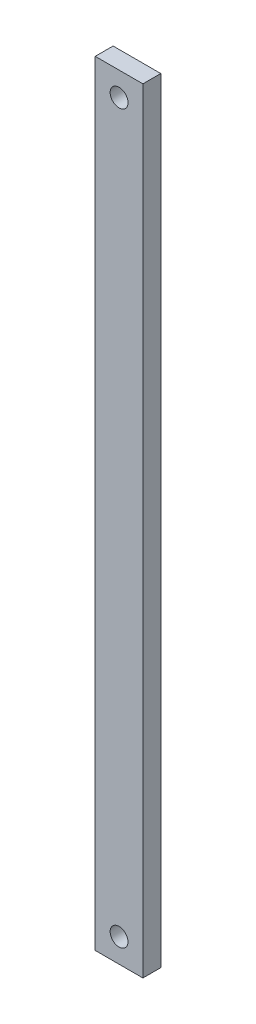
ISO-10303-21;
HEADER;
FILE_DESCRIPTION(('STEP AP214'),'2;1');
FILE_NAME('part.step','',(''),(''),'','','');
FILE_SCHEMA(('AUTOMOTIVE_DESIGN { 1 0 10303 214 1 1 1 1 }'));
ENDSEC;
DATA;
#1=APPLICATION_CONTEXT('core data for automotive mechanical design processes');
#2=APPLICATION_PROTOCOL_DEFINITION('international standard','automotive_design',2000,#1);
#3=PRODUCT_CONTEXT('',#1,'mechanical');
#4=PRODUCT('Part','Part','',(#3));
#5=PRODUCT_RELATED_PRODUCT_CATEGORY('part','',(#4));
#6=PRODUCT_DEFINITION_FORMATION('','',#4);
#7=PRODUCT_DEFINITION_CONTEXT('part definition',#1,'design');
#8=PRODUCT_DEFINITION('design','',#6,#7);
#9=PRODUCT_DEFINITION_SHAPE('','',#8);
#10=(LENGTH_UNIT() NAMED_UNIT(*) SI_UNIT(.MILLI.,.METRE.));
#11=(NAMED_UNIT(*) PLANE_ANGLE_UNIT() SI_UNIT($,.RADIAN.));
#12=(NAMED_UNIT(*) SI_UNIT($,.STERADIAN.) SOLID_ANGLE_UNIT());
#13=UNCERTAINTY_MEASURE_WITH_UNIT(LENGTH_MEASURE(1.E-05),#10,'distance_accuracy_value','');
#14=(GEOMETRIC_REPRESENTATION_CONTEXT(3) GLOBAL_UNCERTAINTY_ASSIGNED_CONTEXT((#13)) GLOBAL_UNIT_ASSIGNED_CONTEXT((#10,
#11,#12)) REPRESENTATION_CONTEXT('',''));
#15=CARTESIAN_POINT('',(0.,0.,0.));
#16=DIRECTION('',(0.,0.,1.));
#17=DIRECTION('',(1.,0.,0.));
#18=AXIS2_PLACEMENT_3D('',#15,#16,#17);
#19=CARTESIAN_POINT('',(-4.,-4.,3.));
#20=DIRECTION('',(0.,0.,1.));
#21=DIRECTION('',(1.,0.,0.));
#22=AXIS2_PLACEMENT_3D('',#19,#20,#21);
#23=PLANE('',#22);
#24=CARTESIAN_POINT('',(0.,122.,3.));
#25=DIRECTION('',(0.,0.,1.));
#26=DIRECTION('',(1.,0.,0.));
#27=AXIS2_PLACEMENT_3D('',#24,#25,#26);
#28=CIRCLE('',#27,1.5);
#29=CARTESIAN_POINT('',(1.5,122.,3.));
#30=VERTEX_POINT('',#29);
#31=EDGE_CURVE('E85',#30,#30,#28,.T.);
#32=ORIENTED_EDGE('',*,*,#31,.F.);
#33=EDGE_LOOP('',(#32));
#34=FACE_BOUND('',#33,.T.);
#35=DIRECTION('',(0.,-1.,0.));
#36=VECTOR('',#35,1.);
#37=CARTESIAN_POINT('',(-4.,126.,3.));
#38=LINE('',#37,#36);
#39=CARTESIAN_POINT('',(-4.,126.,3.));
#40=VERTEX_POINT('',#39);
#41=CARTESIAN_POINT('',(-4.,-4.,3.));
#42=VERTEX_POINT('',#41);
#43=EDGE_CURVE('E95',#40,#42,#38,.T.);
#44=ORIENTED_EDGE('',*,*,#43,.T.);
#45=DIRECTION('',(1.,0.,0.));
#46=VECTOR('',#45,1.);
#47=CARTESIAN_POINT('',(-4.,-4.,3.));
#48=LINE('',#47,#46);
#49=CARTESIAN_POINT('',(4.,-4.,3.));
#50=VERTEX_POINT('',#49);
#51=EDGE_CURVE('E80',#42,#50,#48,.T.);
#52=ORIENTED_EDGE('',*,*,#51,.T.);
#53=DIRECTION('',(0.,1.,0.));
#54=VECTOR('',#53,1.);
#55=CARTESIAN_POINT('',(4.,126.,3.));
#56=LINE('',#55,#54);
#57=CARTESIAN_POINT('',(4.,126.,3.));
#58=VERTEX_POINT('',#57);
#59=EDGE_CURVE('E46',#50,#58,#56,.T.);
#60=ORIENTED_EDGE('',*,*,#59,.T.);
#61=DIRECTION('',(-1.,0.,0.));
#62=VECTOR('',#61,1.);
#63=CARTESIAN_POINT('',(-4.,126.,3.));
#64=LINE('',#63,#62);
#65=EDGE_CURVE('E41',#58,#40,#64,.T.);
#66=ORIENTED_EDGE('',*,*,#65,.T.);
#67=EDGE_LOOP('',(#44,#52,#60,#66));
#68=FACE_BOUND('',#67,.T.);
#69=CARTESIAN_POINT('',(0.,0.,3.));
#70=DIRECTION('',(0.,0.,1.));
#71=DIRECTION('',(1.,0.,0.));
#72=AXIS2_PLACEMENT_3D('',#69,#70,#71);
#73=CIRCLE('',#72,1.5);
#74=CARTESIAN_POINT('',(1.5,0.,3.));
#75=VERTEX_POINT('',#74);
#76=EDGE_CURVE('E113',#75,#75,#73,.T.);
#77=ORIENTED_EDGE('',*,*,#76,.F.);
#78=EDGE_LOOP('',(#77));
#79=FACE_BOUND('',#78,.T.);
#80=ADVANCED_FACE('F26',(#34,#68,#79),#23,.T.);
#81=CARTESIAN_POINT('',(-4.,-4.,0.));
#82=DIRECTION('',(0.,0.,1.));
#83=DIRECTION('',(1.,0.,0.));
#84=AXIS2_PLACEMENT_3D('',#81,#82,#83);
#85=PLANE('',#84);
#86=CARTESIAN_POINT('',(0.,122.,0.));
#87=DIRECTION('',(0.,0.,1.));
#88=DIRECTION('',(1.,0.,0.));
#89=AXIS2_PLACEMENT_3D('',#86,#87,#88);
#90=CIRCLE('',#89,1.5);
#91=CARTESIAN_POINT('',(1.5,122.,0.));
#92=VERTEX_POINT('',#91);
#93=EDGE_CURVE('E88',#92,#92,#90,.T.);
#94=ORIENTED_EDGE('',*,*,#93,.T.);
#95=EDGE_LOOP('',(#94));
#96=FACE_BOUND('',#95,.T.);
#97=DIRECTION('',(0.,-1.,0.));
#98=VECTOR('',#97,1.);
#99=CARTESIAN_POINT('',(-4.,126.,0.));
#100=LINE('',#99,#98);
#101=CARTESIAN_POINT('',(-4.,126.,0.));
#102=VERTEX_POINT('',#101);
#103=CARTESIAN_POINT('',(-4.,-4.,0.));
#104=VERTEX_POINT('',#103);
#105=EDGE_CURVE('E72',#102,#104,#100,.T.);
#106=ORIENTED_EDGE('',*,*,#105,.F.);
#107=DIRECTION('',(-1.,0.,0.));
#108=VECTOR('',#107,1.);
#109=CARTESIAN_POINT('',(-4.,126.,0.));
#110=LINE('',#109,#108);
#111=CARTESIAN_POINT('',(4.,126.,0.));
#112=VERTEX_POINT('',#111);
#113=EDGE_CURVE('E93',#112,#102,#110,.T.);
#114=ORIENTED_EDGE('',*,*,#113,.F.);
#115=DIRECTION('',(0.,1.,0.));
#116=VECTOR('',#115,1.);
#117=CARTESIAN_POINT('',(4.,126.,0.));
#118=LINE('',#117,#116);
#119=CARTESIAN_POINT('',(4.,-4.,0.));
#120=VERTEX_POINT('',#119);
#121=EDGE_CURVE('E73',#120,#112,#118,.T.);
#122=ORIENTED_EDGE('',*,*,#121,.F.);
#123=DIRECTION('',(1.,0.,0.));
#124=VECTOR('',#123,1.);
#125=CARTESIAN_POINT('',(-4.,-4.,0.));
#126=LINE('',#125,#124);
#127=EDGE_CURVE('E67',#104,#120,#126,.T.);
#128=ORIENTED_EDGE('',*,*,#127,.F.);
#129=EDGE_LOOP('',(#106,#114,#122,#128));
#130=FACE_BOUND('',#129,.T.);
#131=CARTESIAN_POINT('',(0.,0.,0.));
#132=DIRECTION('',(0.,0.,1.));
#133=DIRECTION('',(1.,0.,0.));
#134=AXIS2_PLACEMENT_3D('',#131,#132,#133);
#135=CIRCLE('',#134,1.5);
#136=CARTESIAN_POINT('',(1.5,0.,0.));
#137=VERTEX_POINT('',#136);
#138=EDGE_CURVE('E115',#137,#137,#135,.T.);
#139=ORIENTED_EDGE('',*,*,#138,.T.);
#140=EDGE_LOOP('',(#139));
#141=FACE_BOUND('',#140,.T.);
#142=ADVANCED_FACE('F68',(#96,#130,#141),#85,.F.);
#143=CARTESIAN_POINT('',(-4.,126.,3.));
#144=DIRECTION('',(1.,0.,0.));
#145=DIRECTION('',(0.,1.,0.));
#146=AXIS2_PLACEMENT_3D('',#143,#144,#145);
#147=PLANE('',#146);
#148=ORIENTED_EDGE('',*,*,#105,.T.);
#149=DIRECTION('',(0.,0.,-1.));
#150=VECTOR('',#149,1.);
#151=CARTESIAN_POINT('',(-4.,-4.,3.));
#152=LINE('',#151,#150);
#153=EDGE_CURVE('E11',#42,#104,#152,.T.);
#154=ORIENTED_EDGE('',*,*,#153,.F.);
#155=ORIENTED_EDGE('',*,*,#43,.F.);
#156=DIRECTION('',(0.,0.,-1.));
#157=VECTOR('',#156,1.);
#158=CARTESIAN_POINT('',(-4.,126.,3.));
#159=LINE('',#158,#157);
#160=EDGE_CURVE('E84',#40,#102,#159,.T.);
#161=ORIENTED_EDGE('',*,*,#160,.T.);
#162=EDGE_LOOP('',(#148,#154,#155,#161));
#163=FACE_BOUND('',#162,.T.);
#164=ADVANCED_FACE('F28',(#163),#147,.F.);
#165=CARTESIAN_POINT('',(-4.,-4.,3.));
#166=DIRECTION('',(0.,1.,0.));
#167=DIRECTION('',(0.,0.,1.));
#168=AXIS2_PLACEMENT_3D('',#165,#166,#167);
#169=PLANE('',#168);
#170=ORIENTED_EDGE('',*,*,#127,.T.);
#171=DIRECTION('',(0.,0.,-1.));
#172=VECTOR('',#171,1.);
#173=CARTESIAN_POINT('',(4.,-4.,3.));
#174=LINE('',#173,#172);
#175=EDGE_CURVE('E34',#50,#120,#174,.T.);
#176=ORIENTED_EDGE('',*,*,#175,.F.);
#177=ORIENTED_EDGE('',*,*,#51,.F.);
#178=ORIENTED_EDGE('',*,*,#153,.T.);
#179=EDGE_LOOP('',(#170,#176,#177,#178));
#180=FACE_BOUND('',#179,.T.);
#181=ADVANCED_FACE('F79',(#180),#169,.F.);
#182=CARTESIAN_POINT('',(4.,126.,3.));
#183=DIRECTION('',(-1.,0.,0.));
#184=DIRECTION('',(0.,-1.,0.));
#185=AXIS2_PLACEMENT_3D('',#182,#183,#184);
#186=PLANE('',#185);
#187=ORIENTED_EDGE('',*,*,#121,.T.);
#188=DIRECTION('',(0.,0.,-1.));
#189=VECTOR('',#188,1.);
#190=CARTESIAN_POINT('',(4.,126.,3.));
#191=LINE('',#190,#189);
#192=EDGE_CURVE('E101',#58,#112,#191,.T.);
#193=ORIENTED_EDGE('',*,*,#192,.F.);
#194=ORIENTED_EDGE('',*,*,#59,.F.);
#195=ORIENTED_EDGE('',*,*,#175,.T.);
#196=EDGE_LOOP('',(#187,#193,#194,#195));
#197=FACE_BOUND('',#196,.T.);
#198=ADVANCED_FACE('F104',(#197),#186,.F.);
#199=CARTESIAN_POINT('',(-4.,126.,3.));
#200=DIRECTION('',(0.,-1.,0.));
#201=DIRECTION('',(0.,0.,-1.));
#202=AXIS2_PLACEMENT_3D('',#199,#200,#201);
#203=PLANE('',#202);
#204=ORIENTED_EDGE('',*,*,#113,.T.);
#205=ORIENTED_EDGE('',*,*,#160,.F.);
#206=ORIENTED_EDGE('',*,*,#65,.F.);
#207=ORIENTED_EDGE('',*,*,#192,.T.);
#208=EDGE_LOOP('',(#204,#205,#206,#207));
#209=FACE_BOUND('',#208,.T.);
#210=ADVANCED_FACE('F106',(#209),#203,.F.);
#211=CARTESIAN_POINT('',(0.,122.,3.));
#212=DIRECTION('',(0.,0.,-1.));
#213=DIRECTION('',(-1.,0.,0.));
#214=AXIS2_PLACEMENT_3D('',#211,#212,#213);
#215=CYLINDRICAL_SURFACE('',#214,1.5);
#216=ORIENTED_EDGE('',*,*,#31,.T.);
#217=EDGE_LOOP('',(#216));
#218=FACE_BOUND('',#217,.T.);
#219=ORIENTED_EDGE('',*,*,#93,.F.);
#220=EDGE_LOOP('',(#219));
#221=FACE_BOUND('',#220,.T.);
#222=ADVANCED_FACE('F124',(#218,#221),#215,.F.);
#223=CARTESIAN_POINT('',(0.,0.,3.));
#224=DIRECTION('',(0.,0.,-1.));
#225=DIRECTION('',(-1.,0.,0.));
#226=AXIS2_PLACEMENT_3D('',#223,#224,#225);
#227=CYLINDRICAL_SURFACE('',#226,1.5);
#228=ORIENTED_EDGE('',*,*,#76,.T.);
#229=EDGE_LOOP('',(#228));
#230=FACE_BOUND('',#229,.T.);
#231=ORIENTED_EDGE('',*,*,#138,.F.);
#232=EDGE_LOOP('',(#231));
#233=FACE_BOUND('',#232,.T.);
#234=ADVANCED_FACE('F122',(#230,#233),#227,.F.);
#235=CLOSED_SHELL('',(#80,#142,#164,#181,#198,#210,#222,#234));
#236=MANIFOLD_SOLID_BREP('B2',#235);
#237=ADVANCED_BREP_SHAPE_REPRESENTATION('',(#18,#236),#14);
#238=SHAPE_DEFINITION_REPRESENTATION(#9,#237);
ENDSEC;
END-ISO-10303-21;
